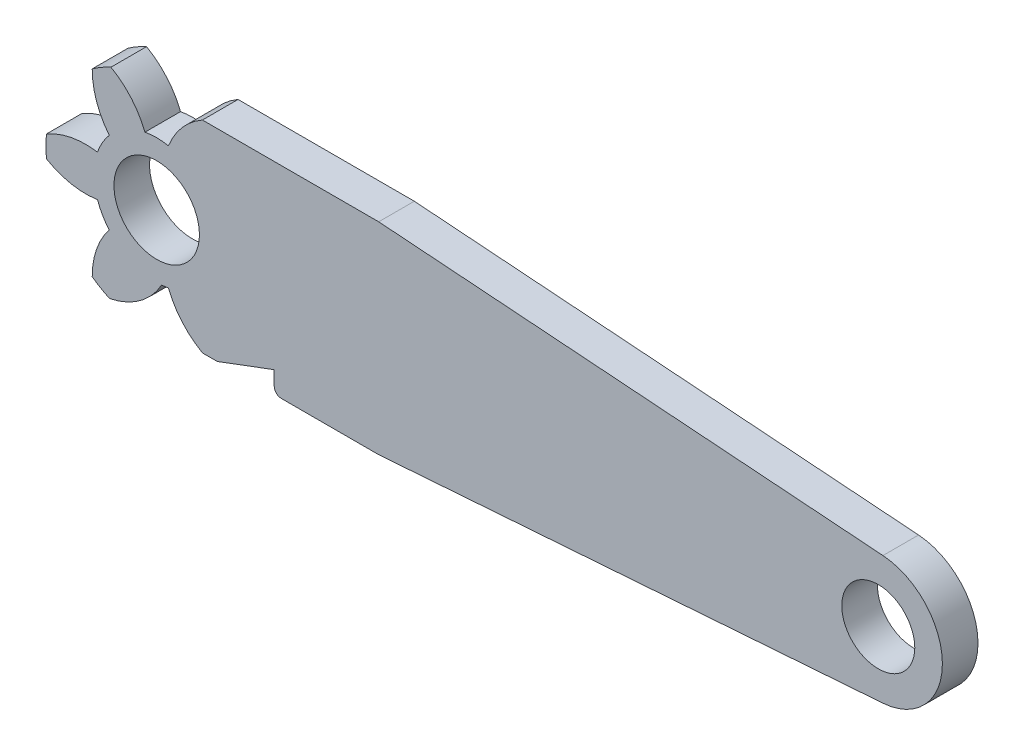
from build123d import *

# Parameters (mm, degrees)
ESQUISSE1_R          = 6
ESQUISSE1_R_2        = 5.124999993
BASE_EXTRUSION_DEPTH = 5


with BuildPart() as part:
    # Esquisse1 → Base-Extrusion (new body)
    with BuildSketch(Plane.XY):
        with BuildLine():
            Line((99.380111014, 197.671390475), (91.380111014, 194.671390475))
            Line((91.380111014, 194.671390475), (89.300209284, 194.671390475))
            ThreePointArc((89.300209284, 194.671390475), (86.441967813, 197.021218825), (84.531362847, 200.189945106))
            ThreePointArc((84.531362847, 200.189945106), (84.055452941, 200.11238034), (83.57600813, 200.061007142))
            ThreePointArc((83.57600813, 200.061007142), (80.496598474, 196.610449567), (76.25618596, 194.764369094))
            ThreePointArc((76.25618596, 194.764369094), (75.009323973, 195.422043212), (73.827157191, 196.1899506))
            ThreePointArc((73.827157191, 196.1899506), (74.433047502, 199.840174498), (76.221942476, 203.079170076))
            ThreePointArc((76.221942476, 203.079170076), (75.260030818, 204.432031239), (74.569374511, 205.941501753))
            ThreePointArc((74.569374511, 205.941501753), (70.869874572, 206.01177105), (67.405742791, 207.312166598))
            ThreePointArc((67.405742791, 207.312166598), (67.331403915, 208.830726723), (67.405742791, 210.349286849))
            ThreePointArc((67.405742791, 210.349286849), (70.869874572, 211.649682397), (74.569374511, 211.719951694))
            ThreePointArc((74.569374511, 211.719951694), (75.260030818, 213.229422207), (76.221942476, 214.582283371))
            ThreePointArc((76.221942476, 214.582283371), (74.433047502, 217.821278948), (73.827157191, 221.471502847))
            ThreePointArc((73.827157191, 221.471502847), (75.105099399, 222.295162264), (76.457380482, 222.990062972))
            ThreePointArc((76.457380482, 222.990062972), (79.315621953, 220.640234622), (81.226226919, 217.471508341))
            ThreePointArc((81.226226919, 217.471508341), (82.878794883, 217.628117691), (84.531362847, 217.471508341))
            ThreePointArc((84.531362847, 217.471508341), (86.441967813, 220.640234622), (89.300209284, 222.990062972))
            Line((89.300209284, 222.990062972), (114.048794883, 222.989112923))
            Line((114.048794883, 222.989112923), (184.84175816, 217.806228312))
            ThreePointArc((184.84175816, 217.806228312), (193.184610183, 208.830251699), (184.84175816, 199.854275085))
            Line((184.84175816, 199.854275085), (114.048794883, 194.671390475))
            Line((114.048794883, 194.671390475), (100.380111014, 194.671390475))
            ThreePointArc((100.380111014, 194.671390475), (99.673004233, 194.964283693), (99.380111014, 195.671390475))
            Line((99.380111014, 195.671390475), (99.380111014, 196.949890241))
            Line((99.380111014, 196.949890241), (99.380111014, 197.671390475))
        make_face()
        with Locations((82.878794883, 208.830726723)):
            Circle(ESQUISSE1_R, mode=Mode.SUBTRACT)
        with Locations((184.184610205, 208.830251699)):
            Circle(ESQUISSE1_R_2, mode=Mode.SUBTRACT)
    extrude(amount=BASE_EXTRUSION_DEPTH)


solid = part.part
